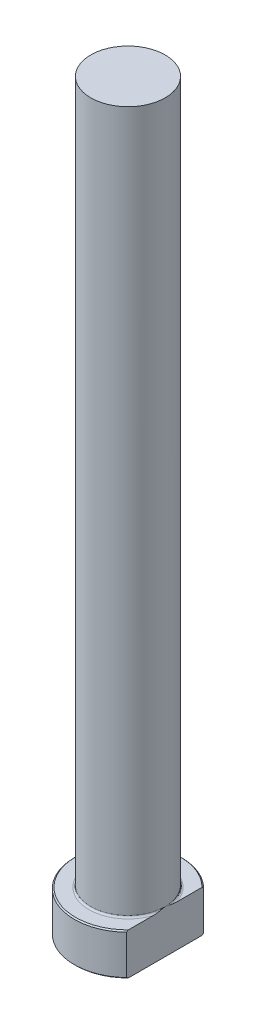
ISO-10303-21;
HEADER;
FILE_DESCRIPTION(('STEP AP214'),'2;1');
FILE_NAME('part.step','',(''),(''),'','','');
FILE_SCHEMA(('AUTOMOTIVE_DESIGN { 1 0 10303 214 1 1 1 1 }'));
ENDSEC;
DATA;
#1=APPLICATION_CONTEXT('core data for automotive mechanical design processes');
#2=APPLICATION_PROTOCOL_DEFINITION('international standard','automotive_design',2000,#1);
#3=PRODUCT_CONTEXT('',#1,'mechanical');
#4=PRODUCT('Part','Part','',(#3));
#5=PRODUCT_RELATED_PRODUCT_CATEGORY('part','',(#4));
#6=PRODUCT_DEFINITION_FORMATION('','',#4);
#7=PRODUCT_DEFINITION_CONTEXT('part definition',#1,'design');
#8=PRODUCT_DEFINITION('design','',#6,#7);
#9=PRODUCT_DEFINITION_SHAPE('','',#8);
#10=(LENGTH_UNIT() NAMED_UNIT(*) SI_UNIT(.MILLI.,.METRE.));
#11=(NAMED_UNIT(*) PLANE_ANGLE_UNIT() SI_UNIT($,.RADIAN.));
#12=(NAMED_UNIT(*) SI_UNIT($,.STERADIAN.) SOLID_ANGLE_UNIT());
#13=UNCERTAINTY_MEASURE_WITH_UNIT(LENGTH_MEASURE(1.E-05),#10,'distance_accuracy_value','');
#14=(GEOMETRIC_REPRESENTATION_CONTEXT(3) GLOBAL_UNCERTAINTY_ASSIGNED_CONTEXT((#13)) GLOBAL_UNIT_ASSIGNED_CONTEXT((#10,
#11,#12)) REPRESENTATION_CONTEXT('',''));
#15=CARTESIAN_POINT('',(0.,0.,0.));
#16=DIRECTION('',(0.,0.,1.));
#17=DIRECTION('',(1.,0.,0.));
#18=AXIS2_PLACEMENT_3D('',#15,#16,#17);
#19=CARTESIAN_POINT('',(0.,0.,0.));
#20=DIRECTION('',(0.,-1.,0.));
#21=DIRECTION('',(0.,0.,-1.));
#22=AXIS2_PLACEMENT_3D('',#19,#20,#21);
#23=PLANE('',#22);
#24=CARTESIAN_POINT('',(0.,0.,0.));
#25=DIRECTION('',(0.,-1.,0.));
#26=DIRECTION('',(0.,0.,-1.));
#27=AXIS2_PLACEMENT_3D('',#24,#25,#26);
#28=CIRCLE('',#27,8.79999999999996);
#29=CARTESIAN_POINT('',(6.24999999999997,0.,6.1949576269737));
#30=VERTEX_POINT('',#29);
#31=CARTESIAN_POINT('',(6.24999999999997,0.,-6.1949576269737));
#32=VERTEX_POINT('',#31);
#33=EDGE_CURVE('E98',#30,#32,#28,.T.);
#34=ORIENTED_EDGE('',*,*,#33,.T.);
#35=DIRECTION('',(0.,0.,1.));
#36=VECTOR('',#35,1.);
#37=CARTESIAN_POINT('',(6.24999999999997,0.,-6.47591692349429));
#38=LINE('',#37,#36);
#39=EDGE_CURVE('E83',#32,#30,#38,.T.);
#40=ORIENTED_EDGE('',*,*,#39,.T.);
#41=EDGE_LOOP('',(#34,#40));
#42=FACE_BOUND('',#41,.T.);
#43=ADVANCED_FACE('F32',(#42),#23,.T.);
#44=CARTESIAN_POINT('',(0.,259.958771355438,0.));
#45=DIRECTION('',(0.,1.,0.));
#46=DIRECTION('',(0.,0.,1.));
#47=AXIS2_PLACEMENT_3D('',#44,#45,#46);
#48=CYLINDRICAL_SURFACE('',#47,8.99999999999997);
#49=CARTESIAN_POINT('',(0.,6.79999999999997,0.));
#50=DIRECTION('',(0.,1.,0.));
#51=DIRECTION('',(0.,0.,1.));
#52=AXIS2_PLACEMENT_3D('',#49,#50,#51);
#53=CIRCLE('',#52,8.99999999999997);
#54=CARTESIAN_POINT('',(6.24999999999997,6.79999999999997,6.47591692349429));
#55=VERTEX_POINT('',#54);
#56=CARTESIAN_POINT('',(6.24999999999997,6.79999999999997,-6.47591692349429));
#57=VERTEX_POINT('',#56);
#58=EDGE_CURVE('E104',#55,#57,#53,.F.);
#59=ORIENTED_EDGE('',*,*,#58,.T.);
#60=DIRECTION('',(0.,-1.,0.));
#61=VECTOR('',#60,1.);
#62=CARTESIAN_POINT('',(6.24999999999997,125.,-6.47591692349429));
#63=LINE('',#62,#61);
#64=CARTESIAN_POINT('',(6.24999999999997,0.199999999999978,-6.47591692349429));
#65=VERTEX_POINT('',#64);
#66=EDGE_CURVE('E183',#57,#65,#63,.T.);
#67=ORIENTED_EDGE('',*,*,#66,.T.);
#68=CARTESIAN_POINT('',(0.,0.199999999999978,0.));
#69=DIRECTION('',(0.,-1.,0.));
#70=DIRECTION('',(0.,0.,-1.));
#71=AXIS2_PLACEMENT_3D('',#68,#69,#70);
#72=CIRCLE('',#71,8.99999999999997);
#73=CARTESIAN_POINT('',(6.24999999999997,0.199999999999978,6.47591692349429));
#74=VERTEX_POINT('',#73);
#75=EDGE_CURVE('E100',#65,#74,#72,.F.);
#76=ORIENTED_EDGE('',*,*,#75,.T.);
#77=DIRECTION('',(0.,-1.,0.));
#78=VECTOR('',#77,1.);
#79=CARTESIAN_POINT('',(6.24999999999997,125.,6.47591692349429));
#80=LINE('',#79,#78);
#81=EDGE_CURVE('E93',#55,#74,#80,.T.);
#82=ORIENTED_EDGE('',*,*,#81,.F.);
#83=EDGE_LOOP('',(#59,#67,#76,#82));
#84=FACE_BOUND('',#83,.T.);
#85=ADVANCED_FACE('F158',(#84),#48,.T.);
#86=CARTESIAN_POINT('',(-8.99999999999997,7.,0.));
#87=DIRECTION('',(0.,1.,0.));
#88=DIRECTION('',(0.,0.,1.));
#89=AXIS2_PLACEMENT_3D('',#86,#87,#88);
#90=PLANE('',#89);
#91=CARTESIAN_POINT('',(0.,7.,0.));
#92=DIRECTION('',(0.,1.,0.));
#93=DIRECTION('',(0.,0.,1.));
#94=AXIS2_PLACEMENT_3D('',#91,#92,#93);
#95=CIRCLE('',#94,8.79999999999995);
#96=CARTESIAN_POINT('',(6.24999999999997,7.,-6.1949576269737));
#97=VERTEX_POINT('',#96);
#98=CARTESIAN_POINT('',(6.24999999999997,7.,6.1949576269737));
#99=VERTEX_POINT('',#98);
#100=EDGE_CURVE('E178',#97,#99,#95,.T.);
#101=ORIENTED_EDGE('',*,*,#100,.T.);
#102=DIRECTION('',(0.,0.,-1.));
#103=VECTOR('',#102,1.);
#104=CARTESIAN_POINT('',(6.24999999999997,7.,0.));
#105=LINE('',#104,#103);
#106=CARTESIAN_POINT('',(6.24999999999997,6.99999999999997,1.95959179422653));
#107=VERTEX_POINT('',#106);
#108=EDGE_CURVE('E57',#99,#107,#105,.T.);
#109=ORIENTED_EDGE('',*,*,#108,.T.);
#110=CARTESIAN_POINT('',(0.,7.,0.));
#111=DIRECTION('',(0.,1.,0.));
#112=DIRECTION('',(0.,0.,1.));
#113=AXIS2_PLACEMENT_3D('',#110,#111,#112);
#114=CIRCLE('',#113,6.54999999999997);
#115=CARTESIAN_POINT('',(6.24999999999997,6.99999999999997,-1.95959179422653));
#116=VERTEX_POINT('',#115);
#117=EDGE_CURVE('E107',#107,#116,#114,.F.);
#118=ORIENTED_EDGE('',*,*,#117,.T.);
#119=EDGE_CURVE('E136',#116,#97,#105,.T.);
#120=ORIENTED_EDGE('',*,*,#119,.T.);
#121=EDGE_LOOP('',(#101,#109,#118,#120));
#122=FACE_BOUND('',#121,.T.);
#123=ADVANCED_FACE('F147',(#122),#90,.T.);
#124=CARTESIAN_POINT('',(0.,7.00000000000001,0.));
#125=DIRECTION('',(0.,-1.,0.));
#126=DIRECTION('',(0.,0.,-1.));
#127=AXIS2_PLACEMENT_3D('',#124,#125,#126);
#128=CONICAL_SURFACE('',#127,8.79999999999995,0.785398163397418);
#129=ORIENTED_EDGE('',*,*,#58,.F.);
#130=CARTESIAN_POINT('',(6.24999999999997,0.241333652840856,14.2481436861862));
#131=CARTESIAN_POINT('',(6.24999999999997,0.433510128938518,14.0382871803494));
#132=CARTESIAN_POINT('',(6.24999999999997,0.62531824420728,13.8280934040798));
#133=CARTESIAN_POINT('',(6.24999999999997,1.00808847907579,13.4069339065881));
#134=CARTESIAN_POINT('',(6.24999999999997,1.19905059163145,13.1959681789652));
#135=CARTESIAN_POINT('',(6.24999999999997,1.77058893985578,12.5616726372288));
#136=CARTESIAN_POINT('',(6.24999999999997,2.14972657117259,12.1370432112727));
#137=CARTESIAN_POINT('',(6.24999999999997,2.90544742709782,11.2804244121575));
#138=CARTESIAN_POINT('',(6.24999999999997,3.28199640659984,10.8484047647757));
#139=CARTESIAN_POINT('',(6.24999999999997,4.02800319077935,9.97835973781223));
#140=CARTESIAN_POINT('',(6.24999999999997,4.39746188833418,9.54033512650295));
#141=CARTESIAN_POINT('',(6.24999999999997,5.0661955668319,8.72902037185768));
#142=CARTESIAN_POINT('',(6.24999999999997,5.36698522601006,8.35698524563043));
#143=CARTESIAN_POINT('',(6.24999999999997,5.81091107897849,7.79312105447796));
#144=CARTESIAN_POINT('',(6.24999999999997,5.95769918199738,7.60416746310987));
#145=CARTESIAN_POINT('',(6.24999999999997,6.24834991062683,7.22402635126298));
#146=CARTESIAN_POINT('',(6.24999999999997,6.39221261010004,7.03283888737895));
#147=CARTESIAN_POINT('',(6.24999999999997,6.67624882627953,6.64809388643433));
#148=CARTESIAN_POINT('',(6.24999999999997,6.81642658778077,6.4545394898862));
#149=CARTESIAN_POINT('',(6.24999999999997,7.0925006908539,6.06440831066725));
#150=CARTESIAN_POINT('',(6.24999999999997,7.22839726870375,5.86783169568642));
#151=CARTESIAN_POINT('',(6.24999999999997,7.49487226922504,5.47121725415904));
#152=CARTESIAN_POINT('',(6.24999999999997,7.62545297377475,5.27118096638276));
#153=CARTESIAN_POINT('',(6.24999999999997,7.88005759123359,4.86699392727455));
#154=CARTESIAN_POINT('',(6.24999999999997,8.00408234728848,4.66284370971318));
#155=CARTESIAN_POINT('',(6.24999999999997,8.24192682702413,4.25315549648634));
#156=CARTESIAN_POINT('',(6.24999999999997,8.35588135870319,4.04769623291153));
#157=CARTESIAN_POINT('',(6.24999999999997,8.57376120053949,3.6314565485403));
#158=CARTESIAN_POINT('',(6.24999999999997,8.67768550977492,3.42067559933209));
#159=CARTESIAN_POINT('',(6.24999999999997,8.87268822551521,2.99352725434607));
#160=CARTESIAN_POINT('',(6.24999999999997,8.96378316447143,2.77716748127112));
#161=CARTESIAN_POINT('',(6.24999999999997,9.12997532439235,2.33835397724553));
#162=CARTESIAN_POINT('',(6.24999999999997,9.20507709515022,2.11590199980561));
#163=CARTESIAN_POINT('',(6.24999999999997,9.32245998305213,1.71047588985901));
#164=CARTESIAN_POINT('',(6.24999999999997,9.368303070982,1.5285390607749));
#165=CARTESIAN_POINT('',(6.24999999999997,9.44550018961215,1.16159607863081));
#166=CARTESIAN_POINT('',(6.24999999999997,9.47685624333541,0.976590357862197));
#167=CARTESIAN_POINT('',(6.24999999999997,9.52348341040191,0.605004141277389));
#168=CARTESIAN_POINT('',(6.24999999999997,9.53879458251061,0.418428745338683));
#169=CARTESIAN_POINT('',(6.24999999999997,9.55263073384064,0.0446485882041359));
#170=CARTESIAN_POINT('',(6.24999999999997,9.55115595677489,-0.142556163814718));
#171=CARTESIAN_POINT('',(6.24999999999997,9.53151010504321,-0.515964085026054));
#172=CARTESIAN_POINT('',(6.24999999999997,9.51334871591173,-0.702167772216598));
#173=CARTESIAN_POINT('',(6.24999999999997,9.46132296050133,-1.07235055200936));
#174=CARTESIAN_POINT('',(6.24999999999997,9.42745724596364,-1.2563294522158));
#175=CARTESIAN_POINT('',(6.24999999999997,9.34551825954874,-1.621613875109));
#176=CARTESIAN_POINT('',(6.24999999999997,9.29740414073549,-1.80291011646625));
#177=CARTESIAN_POINT('',(6.24999999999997,9.18891949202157,-2.16174722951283));
#178=CARTESIAN_POINT('',(6.24999999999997,9.12854919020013,-2.33928817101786));
#179=CARTESIAN_POINT('',(6.24999999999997,8.98038960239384,-2.73619642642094));
#180=CARTESIAN_POINT('',(6.24999999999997,8.88955370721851,-2.9544204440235));
#181=CARTESIAN_POINT('',(6.24999999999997,8.69480317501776,-3.38500003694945));
#182=CARTESIAN_POINT('',(6.24999999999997,8.59088203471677,-3.59735262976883));
#183=CARTESIAN_POINT('',(6.24999999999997,8.37253952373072,-4.01706977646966));
#184=CARTESIAN_POINT('',(6.24999999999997,8.25809823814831,-4.22442389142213));
#185=CARTESIAN_POINT('',(6.24999999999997,8.02107167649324,-4.6343477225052));
#186=CARTESIAN_POINT('',(6.24999999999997,7.89848770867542,-4.83691820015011));
#187=CARTESIAN_POINT('',(6.24999999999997,7.64548625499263,-5.24008406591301));
#188=CARTESIAN_POINT('',(6.24999999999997,7.51499955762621,-5.44063581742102));
#189=CARTESIAN_POINT('',(6.24999999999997,7.24868510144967,-5.83817237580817));
#190=CARTESIAN_POINT('',(6.24999999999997,7.11285688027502,-6.0351568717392));
#191=CARTESIAN_POINT('',(6.24999999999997,6.83683288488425,-6.42612120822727));
#192=CARTESIAN_POINT('',(6.24999999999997,6.69663581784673,-6.62010013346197));
#193=CARTESIAN_POINT('',(6.24999999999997,6.41268260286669,-7.00543858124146));
#194=CARTESIAN_POINT('',(6.24999999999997,6.26892633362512,-7.1967980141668));
#195=CARTESIAN_POINT('',(6.24999999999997,5.89056224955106,-7.69242940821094));
#196=CARTESIAN_POINT('',(6.24999999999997,5.65363599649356,-7.99493062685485));
#197=CARTESIAN_POINT('',(6.24999999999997,5.17412949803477,-8.59529922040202));
#198=CARTESIAN_POINT('',(6.24999999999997,4.93155037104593,-8.89316749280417));
#199=CARTESIAN_POINT('',(6.24999999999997,4.44181409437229,-9.4854430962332));
#200=CARTESIAN_POINT('',(6.24999999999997,4.19465400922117,-9.77984799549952));
#201=CARTESIAN_POINT('',(6.24999999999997,3.69683790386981,-10.3657062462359));
#202=CARTESIAN_POINT('',(6.24999999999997,3.44618171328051,-10.6571594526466));
#203=CARTESIAN_POINT('',(6.24999999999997,2.95199448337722,-11.2262122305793));
#204=CARTESIAN_POINT('',(6.24999999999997,2.70857128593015,-11.5039055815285));
#205=CARTESIAN_POINT('',(6.24999999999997,2.21961081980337,-12.0574158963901));
#206=CARTESIAN_POINT('',(6.24999999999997,1.97407358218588,-12.3332328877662));
#207=CARTESIAN_POINT('',(6.24999999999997,1.48150971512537,-12.882995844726));
#208=CARTESIAN_POINT('',(6.24999999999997,1.23448497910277,-13.1569435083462));
#209=CARTESIAN_POINT('',(6.24999999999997,0.738953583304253,-13.7034947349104));
#210=CARTESIAN_POINT('',(6.24999999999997,0.490446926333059,-13.9760983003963));
#211=CARTESIAN_POINT('',(6.24999999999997,0.241333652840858,-14.2481436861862));
#212=B_SPLINE_CURVE_WITH_KNOTS('',3,(#130,#131,#132,#133,#134,#135,#136,#137,#138,#139,#140,
#141,#142,#143,#144,#145,#146,#147,#148,#149,#150,#151,#152,#153,#154,#155,#156,#157,#158,#159,
#160,#161,#162,#163,#164,#165,#166,#167,#168,#169,#170,#171,#172,#173,#174,#175,#176,#177,#178,
#179,#180,#181,#182,#183,#184,#185,#186,#187,#188,#189,#190,#191,#192,#193,#194,#195,#196,#197,
#198,#199,#200,#201,#202,#203,#204,#205,#206,#207,#208,#209,#210,#211),.UNSPECIFIED.,.F.,.F.,(4,
2,2,2,2,2,2,2,2,2,2,2,2,2,2,2,2,2,2,2,2,2,2,2,2,2,2,2,2,2,2,2,2,2,2,2,2,2,2,2,4),(0.,
0.853664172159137,1.70733543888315,3.41508002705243,5.13429133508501,6.85328470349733,
8.28840776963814,9.00619588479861,9.72396585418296,10.440869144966,11.1577328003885,
11.8742854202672,12.5907456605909,13.2953619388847,14.0000484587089,14.7038184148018,
15.407387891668,15.9697505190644,16.5320345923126,17.0929114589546,17.6537801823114,
18.2143235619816,18.7749150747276,19.3371294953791,19.8993334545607,20.6078926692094,
21.3168054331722,22.027088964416,22.7372586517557,23.4549493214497,24.172702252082,
24.8906696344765,25.6086615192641,26.7612833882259,27.9136791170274,29.0668407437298,
30.2200587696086,31.3278889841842,32.4357029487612,33.5423213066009,34.6489375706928),.UNSPECIFIED.);
#213=EDGE_CURVE('E135',#55,#99,#212,.T.);
#214=ORIENTED_EDGE('',*,*,#213,.T.);
#215=ORIENTED_EDGE('',*,*,#100,.F.);
#216=EDGE_CURVE('E127',#97,#57,#212,.T.);
#217=ORIENTED_EDGE('',*,*,#216,.T.);
#218=EDGE_LOOP('',(#129,#214,#215,#217));
#219=FACE_BOUND('',#218,.T.);
#220=ADVANCED_FACE('F143',(#219),#128,.T.);
#221=CARTESIAN_POINT('',(0.,0.199999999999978,0.));
#222=DIRECTION('',(0.,1.,0.));
#223=DIRECTION('',(0.,0.,1.));
#224=AXIS2_PLACEMENT_3D('',#221,#222,#223);
#225=CONICAL_SURFACE('',#224,8.99999999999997,0.785398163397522);
#226=ORIENTED_EDGE('',*,*,#75,.F.);
#227=CARTESIAN_POINT('',(6.24999999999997,6.75866634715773,-14.2481436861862));
#228=CARTESIAN_POINT('',(6.24999999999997,6.56648987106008,-14.0382871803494));
#229=CARTESIAN_POINT('',(6.24999999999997,6.37468175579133,-13.8280934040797));
#230=CARTESIAN_POINT('',(6.24999999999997,5.99191152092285,-13.406933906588));
#231=CARTESIAN_POINT('',(6.24999999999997,5.8009494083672,-13.195968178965));
#232=CARTESIAN_POINT('',(6.24999999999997,5.22941106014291,-12.5616726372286));
#233=CARTESIAN_POINT('',(6.24999999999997,4.85027342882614,-12.1370432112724));
#234=CARTESIAN_POINT('',(6.24999999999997,4.09455257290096,-11.2804244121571));
#235=CARTESIAN_POINT('',(6.24999999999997,3.71800359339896,-10.8484047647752));
#236=CARTESIAN_POINT('',(6.24999999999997,2.97199680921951,-9.97835973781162));
#237=CARTESIAN_POINT('',(6.24999999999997,2.60253811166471,-9.54033512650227));
#238=CARTESIAN_POINT('',(6.24999999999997,1.93380443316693,-8.72902037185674));
#239=CARTESIAN_POINT('',(6.24999999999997,1.6330147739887,-8.35698524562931));
#240=CARTESIAN_POINT('',(6.24999999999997,1.18908892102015,-7.79312105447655));
#241=CARTESIAN_POINT('',(6.24999999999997,1.04230081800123,-7.60416746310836));
#242=CARTESIAN_POINT('',(6.24999999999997,0.751650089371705,-7.22402635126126));
#243=CARTESIAN_POINT('',(6.24999999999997,0.607787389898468,-7.03283888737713));
#244=CARTESIAN_POINT('',(6.24999999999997,0.323751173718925,-6.64809388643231));
#245=CARTESIAN_POINT('',(6.24999999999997,0.183573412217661,-6.45453948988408));
#246=CARTESIAN_POINT('',(6.24999999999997,-0.0925006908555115,-6.06440831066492));
#247=CARTESIAN_POINT('',(6.24999999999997,-0.228397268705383,-5.86783169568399));
#248=CARTESIAN_POINT('',(6.24999999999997,-0.494872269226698,-5.47121725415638));
#249=CARTESIAN_POINT('',(6.24999999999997,-0.625452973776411,-5.27118096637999));
#250=CARTESIAN_POINT('',(6.24999999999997,-0.880057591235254,-4.86699392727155));
#251=CARTESIAN_POINT('',(6.24999999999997,-1.00408234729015,-4.66284370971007));
#252=CARTESIAN_POINT('',(6.24999999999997,-1.24192682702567,-4.25315549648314));
#253=CARTESIAN_POINT('',(6.24999999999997,-1.35588135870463,-4.04769623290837));
#254=CARTESIAN_POINT('',(6.24999999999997,-1.57376120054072,-3.63145654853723));
#255=CARTESIAN_POINT('',(6.24999999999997,-1.67768550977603,-3.42067559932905));
#256=CARTESIAN_POINT('',(6.24999999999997,-1.8726882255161,-2.99352725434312));
#257=CARTESIAN_POINT('',(6.24999999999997,-1.96378316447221,-2.77716748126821));
#258=CARTESIAN_POINT('',(6.24999999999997,-2.1299753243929,-2.33835397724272));
#259=CARTESIAN_POINT('',(6.24999999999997,-2.20507709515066,-2.11590199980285));
#260=CARTESIAN_POINT('',(6.24999999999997,-2.32245998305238,-1.71047588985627));
#261=CARTESIAN_POINT('',(6.24999999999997,-2.36830307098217,-1.52853906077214));
#262=CARTESIAN_POINT('',(6.24999999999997,-2.44550018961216,-1.16159607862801));
#263=CARTESIAN_POINT('',(6.24999999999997,-2.47685624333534,-0.976590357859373));
#264=CARTESIAN_POINT('',(6.24999999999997,-2.52348341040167,-0.605004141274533));
#265=CARTESIAN_POINT('',(6.24999999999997,-2.53879458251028,-0.418428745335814));
#266=CARTESIAN_POINT('',(6.24999999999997,-2.55263073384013,-0.0446485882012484));
#267=CARTESIAN_POINT('',(6.24999999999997,-2.5511559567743,0.142556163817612));
#268=CARTESIAN_POINT('',(6.24999999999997,-2.53151010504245,0.515964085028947));
#269=CARTESIAN_POINT('',(6.24999999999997,-2.51334871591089,0.702167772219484));
#270=CARTESIAN_POINT('',(6.24999999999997,-2.46132296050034,1.07235055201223));
#271=CARTESIAN_POINT('',(6.24999999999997,-2.42745724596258,1.25632945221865));
#272=CARTESIAN_POINT('',(6.24999999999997,-2.34551825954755,1.62161387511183));
#273=CARTESIAN_POINT('',(6.24999999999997,-2.29740414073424,1.80291011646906));
#274=CARTESIAN_POINT('',(6.24999999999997,-2.18891949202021,2.16174722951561));
#275=CARTESIAN_POINT('',(6.24999999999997,-2.12854919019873,2.33928817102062));
#276=CARTESIAN_POINT('',(6.24999999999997,-1.98038960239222,2.736196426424));
#277=CARTESIAN_POINT('',(6.24999999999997,-1.8895537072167,2.95442044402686));
#278=CARTESIAN_POINT('',(6.24999999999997,-1.69480317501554,3.38500003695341));
#279=CARTESIAN_POINT('',(6.24999999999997,-1.59088203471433,3.59735262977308));
#280=CARTESIAN_POINT('',(6.24999999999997,-1.37253952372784,4.01706977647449));
#281=CARTESIAN_POINT('',(6.24999999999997,-1.25809823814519,4.22442389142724));
#282=CARTESIAN_POINT('',(6.24999999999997,-1.02107167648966,4.63434772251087));
#283=CARTESIAN_POINT('',(6.24999999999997,-0.898487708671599,4.83691820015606));
#284=CARTESIAN_POINT('',(6.24999999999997,-0.645486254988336,5.2400840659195));
#285=CARTESIAN_POINT('',(6.24999999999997,-0.514999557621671,5.44063581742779));
#286=CARTESIAN_POINT('',(6.24999999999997,-0.24868510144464,5.83817237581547));
#287=CARTESIAN_POINT('',(6.24999999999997,-0.112856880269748,6.03515687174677));
#288=CARTESIAN_POINT('',(6.24999999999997,0.16316711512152,6.42612120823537));
#289=CARTESIAN_POINT('',(6.24999999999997,0.303364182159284,6.62010013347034));
#290=CARTESIAN_POINT('',(6.24999999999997,0.587317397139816,7.00543858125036));
#291=CARTESIAN_POINT('',(6.24999999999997,0.73107366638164,7.19679801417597));
#292=CARTESIAN_POINT('',(6.24999999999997,1.10943775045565,7.69242940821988));
#293=CARTESIAN_POINT('',(6.24999999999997,1.34636400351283,7.99493062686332));
#294=CARTESIAN_POINT('',(6.24999999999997,1.82587050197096,8.59529922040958));
#295=CARTESIAN_POINT('',(6.24999999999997,2.06844962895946,8.89316749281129));
#296=CARTESIAN_POINT('',(6.24999999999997,2.55818590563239,9.48544309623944));
#297=CARTESIAN_POINT('',(6.24999999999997,2.80534599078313,9.77984799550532));
#298=CARTESIAN_POINT('',(6.24999999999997,3.30316209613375,10.3657062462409));
#299=CARTESIAN_POINT('',(6.24999999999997,3.55381828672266,10.6571594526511));
#300=CARTESIAN_POINT('',(6.24999999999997,4.04800551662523,11.2262122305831));
#301=CARTESIAN_POINT('',(6.24999999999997,4.29142871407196,11.5039055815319));
#302=CARTESIAN_POINT('',(6.24999999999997,4.78038918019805,12.0574158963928));
#303=CARTESIAN_POINT('',(6.24999999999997,5.02592641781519,12.3332328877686));
#304=CARTESIAN_POINT('',(6.24999999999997,5.51849028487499,12.8829958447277));
#305=CARTESIAN_POINT('',(6.24999999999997,5.76551502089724,13.1569435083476));
#306=CARTESIAN_POINT('',(6.24999999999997,6.26104641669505,13.703494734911));
#307=CARTESIAN_POINT('',(6.24999999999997,6.50955307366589,13.9760983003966));
#308=CARTESIAN_POINT('',(6.24999999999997,6.75866634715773,14.2481436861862));
#309=B_SPLINE_CURVE_WITH_KNOTS('',3,(#227,#228,#229,#230,#231,#232,#233,#234,#235,#236,#237,
#238,#239,#240,#241,#242,#243,#244,#245,#246,#247,#248,#249,#250,#251,#252,#253,#254,#255,#256,
#257,#258,#259,#260,#261,#262,#263,#264,#265,#266,#267,#268,#269,#270,#271,#272,#273,#274,#275,
#276,#277,#278,#279,#280,#281,#282,#283,#284,#285,#286,#287,#288,#289,#290,#291,#292,#293,#294,
#295,#296,#297,#298,#299,#300,#301,#302,#303,#304,#305,#306,#307,#308),.UNSPECIFIED.,.F.,.F.,(4,
2,2,2,2,2,2,2,2,2,2,2,2,2,2,2,2,2,2,2,2,2,2,2,2,2,2,2,2,2,2,2,2,2,2,2,2,2,2,2,4),(0.,
0.853664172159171,1.70733543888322,3.41508002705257,5.13429133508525,6.85328470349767,
8.28840776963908,9.00619588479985,9.72396585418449,10.4408691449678,11.1577328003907,
11.8742854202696,12.5907456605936,13.2953619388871,14.0000484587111,14.7038184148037,
15.4073878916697,15.9697505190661,16.5320345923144,17.0929114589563,17.6537801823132,
18.2143235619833,18.7749150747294,19.3371294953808,19.8993334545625,20.6078926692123,
21.3168054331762,22.027088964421,22.7372586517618,23.4549493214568,24.1727022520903,
24.8906696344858,25.6086615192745,26.7612833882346,27.9136791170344,29.0668407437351,
30.2200587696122,31.3278889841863,32.4357029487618,33.5423213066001,34.6489375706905),.UNSPECIFIED.);
#310=EDGE_CURVE('E86',#65,#32,#309,.T.);
#311=ORIENTED_EDGE('',*,*,#310,.T.);
#312=ORIENTED_EDGE('',*,*,#33,.F.);
#313=EDGE_CURVE('E89',#30,#74,#309,.T.);
#314=ORIENTED_EDGE('',*,*,#313,.T.);
#315=EDGE_LOOP('',(#226,#311,#312,#314));
#316=FACE_BOUND('',#315,.T.);
#317=ADVANCED_FACE('F97',(#316),#225,.T.);
#318=CARTESIAN_POINT('',(0.,7.29999999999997,0.));
#319=DIRECTION('',(0.,1.,0.));
#320=DIRECTION('',(0.,0.,1.));
#321=AXIS2_PLACEMENT_3D('',#318,#319,#320);
#322=TOROIDAL_SURFACE('',#321,6.54999999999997,0.3);
#323=CARTESIAN_POINT('',(6.24999999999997,7.29999999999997,0.));
#324=CARTESIAN_POINT('',(6.24999999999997,7.30000062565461,1.07935811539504E-10));
#325=CARTESIAN_POINT('',(6.24999999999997,7.30000125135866,-2.93503388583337E-07));
#326=CARTESIAN_POINT('',(6.24999999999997,7.300002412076,-1.07409020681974E-06));
#327=CARTESIAN_POINT('',(6.24999999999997,7.30000292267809,-1.58214987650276E-06));
#328=CARTESIAN_POINT('',(6.24999999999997,7.30000400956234,-2.8081901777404E-06));
#329=CARTESIAN_POINT('',(6.24999999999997,7.30000456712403,-3.54604295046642E-06));
#330=CARTESIAN_POINT('',(6.24999999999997,7.30000554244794,-5.05412397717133E-06));
#331=CARTESIAN_POINT('',(6.24999999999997,7.30000596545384,-5.82130991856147E-06));
#332=CARTESIAN_POINT('',(6.24999999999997,7.30000759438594,-8.87270548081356E-06));
#333=CARTESIAN_POINT('',(6.24999999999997,7.30000872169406,-1.1203275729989E-05));
#334=CARTESIAN_POINT('',(6.24999999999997,7.30001051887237,-1.57552363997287E-05));
#335=CARTESIAN_POINT('',(6.24999999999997,7.30001122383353,-1.79632548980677E-05));
#336=CARTESIAN_POINT('',(6.24999999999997,7.30001427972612,-2.752581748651E-05));
#337=CARTESIAN_POINT('',(6.24999999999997,7.30001663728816,-3.48805238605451E-05));
#338=CARTESIAN_POINT('',(6.24999999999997,7.30002001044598,-4.8619148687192E-05));
#339=CARTESIAN_POINT('',(6.24999999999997,7.30002118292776,-5.49639235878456E-05));
#340=CARTESIAN_POINT('',(6.24999999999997,7.30002986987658,-0.000102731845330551));
#341=CARTESIAN_POINT('',(6.24999999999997,7.30003662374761,-0.000144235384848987));
#342=CARTESIAN_POINT('',(6.24999999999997,7.30006617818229,-0.000309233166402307));
#343=CARTESIAN_POINT('',(6.24999999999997,7.3000942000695,-0.000431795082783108));
#344=CARTESIAN_POINT('',(6.24999999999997,7.30020410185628,-0.000919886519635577));
#345=CARTESIAN_POINT('',(6.24999999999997,7.3002827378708,-0.00128589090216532));
#346=CARTESIAN_POINT('',(6.24999999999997,7.30059929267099,-0.00274922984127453));
#347=CARTESIAN_POINT('',(6.24999999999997,7.30084138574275,-0.00384592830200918));
#348=CARTESIAN_POINT('',(6.24999999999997,7.30185366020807,-0.00844291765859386));
#349=CARTESIAN_POINT('',(6.24999999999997,7.30261854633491,-0.0119440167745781));
#350=CARTESIAN_POINT('',(6.24999999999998,7.30934535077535,-0.0427197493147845));
#351=CARTESIAN_POINT('',(6.24999999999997,7.31532845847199,-0.0699912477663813));
#352=CARTESIAN_POINT('',(6.24999999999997,7.32701994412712,-0.1234289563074));
#353=CARTESIAN_POINT('',(6.24999999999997,7.33272958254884,-0.14959492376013));
#354=CARTESIAN_POINT('',(6.24999999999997,7.34485779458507,-0.205323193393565));
#355=CARTESIAN_POINT('',(6.24999999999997,7.35127239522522,-0.23488638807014));
#356=CARTESIAN_POINT('',(6.24999999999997,7.36411066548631,-0.294356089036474));
#357=CARTESIAN_POINT('',(6.24999999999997,7.37053363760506,-0.324262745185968));
#358=CARTESIAN_POINT('',(6.24999999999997,7.38584616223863,-0.396051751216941));
#359=CARTESIAN_POINT('',(6.24999999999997,7.39469543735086,-0.437942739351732));
#360=CARTESIAN_POINT('',(6.24999999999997,7.41192932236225,-0.520630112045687));
#361=CARTESIAN_POINT('',(6.24999999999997,7.42032002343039,-0.561425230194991));
#362=CARTESIAN_POINT('',(6.24999999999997,7.44742205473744,-0.69545636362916));
#363=CARTESIAN_POINT('',(6.24999999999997,7.4655604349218,-0.788810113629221));
#364=CARTESIAN_POINT('',(6.24999999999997,7.49982037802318,-0.976827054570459));
#365=CARTESIAN_POINT('',(6.24999999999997,7.51592073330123,-1.07149417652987));
#366=CARTESIAN_POINT('',(6.24999999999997,7.54633300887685,-1.27034734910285));
#367=CARTESIAN_POINT('',(6.24999999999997,7.56032934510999,-1.37458266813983));
#368=CARTESIAN_POINT('',(6.24999999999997,7.58288660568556,-1.58337219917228));
#369=CARTESIAN_POINT('',(6.24999999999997,7.59146383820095,-1.68792449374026));
#370=CARTESIAN_POINT('',(6.24999999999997,7.59839530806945,-1.84328437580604));
#371=CARTESIAN_POINT('',(6.24999999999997,7.59974160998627,-1.89395725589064));
#372=CARTESIAN_POINT('',(6.24999999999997,7.60019235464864,-1.99536854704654));
#373=CARTESIAN_POINT('',(6.24999999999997,7.59929473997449,-2.04610697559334));
#374=CARTESIAN_POINT('',(6.24999999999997,7.59472992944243,-2.14676570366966));
#375=CARTESIAN_POINT('',(6.24999999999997,7.5911010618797,-2.19668764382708));
#376=CARTESIAN_POINT('',(6.24999999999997,7.58034281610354,-2.29612823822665));
#377=CARTESIAN_POINT('',(6.24999999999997,7.57321785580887,-2.3456473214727));
#378=CARTESIAN_POINT('',(6.24999999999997,7.55883861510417,-2.41968621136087));
#379=CARTESIAN_POINT('',(6.24999999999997,7.55336305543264,-2.44455073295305));
#380=CARTESIAN_POINT('',(6.24999999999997,7.54088765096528,-2.49388968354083));
#381=CARTESIAN_POINT('',(6.24999999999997,7.53388865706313,-2.51836432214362));
#382=CARTESIAN_POINT('',(6.24999999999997,7.5180160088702,-2.56658659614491));
#383=CARTESIAN_POINT('',(6.24999999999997,7.50915079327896,-2.59033697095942));
#384=CARTESIAN_POINT('',(6.24999999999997,7.48896575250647,-2.63675110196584));
#385=CARTESIAN_POINT('',(6.24999999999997,7.47765263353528,-2.65941762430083));
#386=CARTESIAN_POINT('',(6.24999999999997,7.45696632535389,-2.69385500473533));
#387=CARTESIAN_POINT('',(6.24999999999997,7.4486983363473,-2.70628406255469));
#388=CARTESIAN_POINT('',(6.24999999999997,7.43069170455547,-2.73004308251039));
#389=CARTESIAN_POINT('',(6.24999999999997,7.42095514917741,-2.74137456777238));
#390=CARTESIAN_POINT('',(6.24999999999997,7.40313125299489,-2.75886410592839));
#391=CARTESIAN_POINT('',(6.24999999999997,7.39552792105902,-2.76551055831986));
#392=CARTESIAN_POINT('',(6.24999999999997,7.37942171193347,-2.77761940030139));
#393=CARTESIAN_POINT('',(6.24999999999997,7.37092027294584,-2.78308364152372));
#394=CARTESIAN_POINT('',(6.24999999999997,7.3552039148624,-2.79123019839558));
#395=CARTESIAN_POINT('',(6.24999999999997,7.34817405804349,-2.79426565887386));
#396=CARTESIAN_POINT('',(6.24999999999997,7.33371058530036,-2.79914227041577));
#397=CARTESIAN_POINT('',(6.24999999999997,7.32627746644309,-2.80098485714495));
#398=CARTESIAN_POINT('',(6.24999999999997,7.31114486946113,-2.80329865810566));
#399=CARTESIAN_POINT('',(6.24999999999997,7.30344395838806,-2.8037607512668));
#400=CARTESIAN_POINT('',(6.24999999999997,7.28809169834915,-2.80323167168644));
#401=CARTESIAN_POINT('',(6.24999999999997,7.28044035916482,-2.8022402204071));
#402=CARTESIAN_POINT('',(6.24999999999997,7.26612892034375,-2.79907216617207));
#403=CARTESIAN_POINT('',(6.24999999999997,7.25944213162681,-2.79701213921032));
#404=CARTESIAN_POINT('',(6.24999999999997,7.24643877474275,-2.79195274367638));
#405=CARTESIAN_POINT('',(6.24999999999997,7.24012234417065,-2.78895302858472));
#406=CARTESIAN_POINT('',(6.24999999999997,7.2241404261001,-2.78010234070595));
#407=CARTESIAN_POINT('',(6.24999999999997,7.21481747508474,-2.77363492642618));
#408=CARTESIAN_POINT('',(6.24999999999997,7.19727307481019,-2.75934472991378));
#409=CARTESIAN_POINT('',(6.24999999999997,7.18905534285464,-2.75151756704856));
#410=CARTESIAN_POINT('',(6.24999999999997,7.16746274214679,-2.72838666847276));
#411=CARTESIAN_POINT('',(6.24999999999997,7.15517318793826,-2.71208063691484));
#412=CARTESIAN_POINT('',(6.24999999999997,7.13297830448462,-2.67797126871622));
#413=CARTESIAN_POINT('',(6.24999999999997,7.12307686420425,-2.66016555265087));
#414=CARTESIAN_POINT('',(6.24999999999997,7.10185271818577,-2.61712561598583));
#415=CARTESIAN_POINT('',(6.24999999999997,7.09129494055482,-2.59151849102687));
#416=CARTESIAN_POINT('',(6.24999999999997,7.07260379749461,-2.53941658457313));
#417=CARTESIAN_POINT('',(6.24999999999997,7.06447530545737,-2.51292013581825));
#418=CARTESIAN_POINT('',(6.24999999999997,7.05002040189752,-2.45908915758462));
#419=CARTESIAN_POINT('',(6.24999999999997,7.04371803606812,-2.43174827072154));
#420=CARTESIAN_POINT('',(6.24999999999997,7.03267951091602,-2.37679196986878));
#421=CARTESIAN_POINT('',(6.24999999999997,7.0279416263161,-2.34917689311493));
#422=CARTESIAN_POINT('',(6.24999999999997,7.01732549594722,-2.27736486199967));
#423=CARTESIAN_POINT('',(6.24999999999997,7.01243082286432,-2.23302306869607));
#424=CARTESIAN_POINT('',(6.24999999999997,7.00516057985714,-2.1441265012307));
#425=CARTESIAN_POINT('',(6.24999999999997,7.00278642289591,-2.099571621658));
#426=CARTESIAN_POINT('',(6.24999999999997,6.99868217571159,-1.96551117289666));
#427=CARTESIAN_POINT('',(6.24999999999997,7.0000072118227,-1.87591316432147));
#428=CARTESIAN_POINT('',(6.24999999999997,7.0080292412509,-1.70248618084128));
#429=CARTESIAN_POINT('',(6.24999999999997,7.01439439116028,-1.61863796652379));
#430=CARTESIAN_POINT('',(6.24999999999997,7.03083822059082,-1.45127006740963));
#431=CARTESIAN_POINT('',(6.24999999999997,7.04091883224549,-1.3677505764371));
#432=CARTESIAN_POINT('',(6.24999999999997,7.06480380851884,-1.19431308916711));
#433=CARTESIAN_POINT('',(6.24999999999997,7.07884475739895,-1.10442856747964));
#434=CARTESIAN_POINT('',(6.24999999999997,7.10969415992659,-0.922729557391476));
#435=CARTESIAN_POINT('',(6.24999999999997,7.12656524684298,-0.830925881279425));
#436=CARTESIAN_POINT('',(6.24999999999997,7.15670076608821,-0.67515179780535));
#437=CARTESIAN_POINT('',(6.24999999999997,7.16952837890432,-0.611095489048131));
#438=CARTESIAN_POINT('',(6.24999999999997,7.19564112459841,-0.483838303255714));
#439=CARTESIAN_POINT('',(6.24999999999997,7.2089193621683,-0.420636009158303));
#440=CARTESIAN_POINT('',(6.24999999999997,7.23428285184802,-0.301644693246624));
#441=CARTESIAN_POINT('',(6.24999999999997,7.24632762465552,-0.245846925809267));
#442=CARTESIAN_POINT('',(6.24999999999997,7.27113004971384,-0.131848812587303));
#443=CARTESIAN_POINT('',(6.24999999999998,7.28389583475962,-0.0736501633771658));
#444=CARTESIAN_POINT('',(6.24999999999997,7.29738281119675,-0.0119373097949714));
#445=CARTESIAN_POINT('',(6.24999999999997,7.29814924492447,-0.00842953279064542));
#446=CARTESIAN_POINT('',(6.24999999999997,7.2991618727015,-0.00383105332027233));
#447=CARTESIAN_POINT('',(6.24999999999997,7.29940281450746,-0.00273954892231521));
#448=CARTESIAN_POINT('',(6.24999999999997,7.29971797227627,-0.00128266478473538));
#449=CARTESIAN_POINT('',(6.24999999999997,7.29979633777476,-0.000917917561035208));
#450=CARTESIAN_POINT('',(6.24999999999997,7.29990591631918,-0.000431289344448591));
#451=CARTESIAN_POINT('',(6.24999999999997,7.29993389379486,-0.000308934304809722));
#452=CARTESIAN_POINT('',(6.24999999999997,7.29996340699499,-0.00014417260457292));
#453=CARTESIAN_POINT('',(6.24999999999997,7.29997015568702,-0.000102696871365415));
#454=CARTESIAN_POINT('',(6.24999999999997,7.29997883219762,-5.49575231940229E-05));
#455=CARTESIAN_POINT('',(6.24999999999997,7.29998000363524,-4.86141750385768E-05));
#456=CARTESIAN_POINT('',(6.24999999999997,7.29998337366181,-3.48785875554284E-05));
#457=CARTESIAN_POINT('',(6.24999999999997,7.29998572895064,-2.75254181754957E-05));
#458=CARTESIAN_POINT('',(6.24999999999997,7.29998878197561,-1.79644811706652E-05));
#459=CARTESIAN_POINT('',(6.24999999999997,7.29998948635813,-1.57565691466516E-05));
#460=CARTESIAN_POINT('',(6.24999999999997,7.29999128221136,-1.12047374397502E-05));
#461=CARTESIAN_POINT('',(6.24999999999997,7.29999240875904,-8.87417477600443E-06));
#462=CARTESIAN_POINT('',(6.24999999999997,7.29999403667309,-5.82269238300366E-06));
#463=CARTESIAN_POINT('',(6.24999999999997,7.29999445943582,-5.05545097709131E-06));
#464=CARTESIAN_POINT('',(6.24999999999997,7.29999543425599,-3.54721514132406E-06));
#465=CARTESIAN_POINT('',(6.24999999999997,7.29999599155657,-2.80926073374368E-06));
#466=CARTESIAN_POINT('',(6.24999999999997,7.29999707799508,-1.58298694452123E-06));
#467=CARTESIAN_POINT('',(6.24999999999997,7.29999758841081,-1.07480544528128E-06));
#468=CARTESIAN_POINT('',(6.24999999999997,7.29999874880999,-2.93902319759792E-07));
#469=CARTESIAN_POINT('',(6.24999999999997,7.29999937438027,-1.07929784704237E-10));
#470=CARTESIAN_POINT('',(6.24999999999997,7.29999999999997,0.));
#471=B_SPLINE_CURVE_WITH_KNOTS('',3,(#323,#324,#325,#326,#327,#328,#329,#330,#331,#332,#333,
#334,#335,#336,#337,#338,#339,#340,#341,#342,#343,#344,#345,#346,#347,#348,#349,#350,#351,#352,
#353,#354,#355,#356,#357,#358,#359,#360,#361,#362,#363,#364,#365,#366,#367,#368,#369,#370,#371,
#372,#373,#374,#375,#376,#377,#378,#379,#380,#381,#382,#383,#384,#385,#386,#387,#388,#389,#390,
#391,#392,#393,#394,#395,#396,#397,#398,#399,#400,#401,#402,#403,#404,#405,#406,#407,#408,#409,
#410,#411,#412,#413,#414,#415,#416,#417,#418,#419,#420,#421,#422,#423,#424,#425,#426,#427,#428,
#429,#430,#431,#432,#433,#434,#435,#436,#437,#438,#439,#440,#441,#442,#443,#444,#445,#446,#447,
#448,#449,#450,#451,#452,#453,#454,#455,#456,#457,#458,#459,#460,#461,#462,#463,#464,#465,#466,
#467,#468,#469,#470),.UNSPECIFIED.,.T.,.F.,(4,2,2,2,2,2,2,2,2,2,2,2,2,2,2,2,2,2,2,2,2,2,2,2,2,2,
2,2,2,2,2,2,2,2,2,2,2,2,2,2,2,2,2,2,2,2,2,2,2,2,2,2,2,2,2,2,2,2,2,2,2,2,2,2,2,2,2,2,2,2,2,2,2,
4),(0.,1.91133621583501E-06,4.08629145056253E-06,6.84045192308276E-06,9.46814795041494E-06,
1.72102324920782E-05,2.41571318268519E-05,4.72958844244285E-05,6.66312210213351E-05,
0.000192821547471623,0.000569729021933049,0.0016930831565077,0.00506203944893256,
0.0158134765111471,0.0995718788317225,0.17991734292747,0.270670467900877,0.362436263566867,
0.49088205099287,0.615829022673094,0.901110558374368,1.18915184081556,1.50457944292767,
1.81905322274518,1.97108855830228,2.1232633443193,2.27334154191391,2.42323057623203,
2.49957602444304,2.5758789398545,2.65184396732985,2.72760346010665,2.77231358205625,
2.81696074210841,2.84717821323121,2.87734800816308,2.90023250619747,2.92308941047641,
2.94609700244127,2.96910900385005,2.99001820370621,3.01093512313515,3.04477802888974,
3.07873205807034,3.13964269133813,3.20065185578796,3.28355317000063,3.36661969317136,
3.45073488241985,3.53475699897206,3.66848651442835,3.80229095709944,4.07081278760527,
4.32299246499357,4.57530346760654,4.8481846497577,5.12818350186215,5.32416473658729,
5.51790851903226,5.68915816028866,5.86790059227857,5.87867257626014,5.88202557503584,
5.88314507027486,5.88352134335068,5.88364744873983,5.88366677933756,5.88368991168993,
5.88369685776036,5.88370459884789,5.88370722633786,5.8837099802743,5.88371215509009,
5.88371406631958),.UNSPECIFIED.);
#472=CARTESIAN_POINT('',(6.24999999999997,7.29999999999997,0.));
#473=VERTEX_POINT('',#472);
#474=EDGE_CURVE('E11',#116,#473,#471,.T.);
#475=ORIENTED_EDGE('',*,*,#474,.F.);
#476=ORIENTED_EDGE('',*,*,#117,.F.);
#477=CARTESIAN_POINT('',(6.24999999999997,7.29999999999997,0.));
#478=CARTESIAN_POINT('',(6.24999999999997,7.29999937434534,-1.07935744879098E-10));
#479=CARTESIAN_POINT('',(6.24999999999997,7.29999874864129,2.93503388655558E-07));
#480=CARTESIAN_POINT('',(6.24999999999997,7.29999758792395,1.07409020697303E-06));
#481=CARTESIAN_POINT('',(6.24999999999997,7.29999707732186,1.58214987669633E-06));
#482=CARTESIAN_POINT('',(6.24999999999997,7.2999959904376,2.80819017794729E-06));
#483=CARTESIAN_POINT('',(6.24999999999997,7.29999543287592,3.54604295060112E-06));
#484=CARTESIAN_POINT('',(6.24999999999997,7.29999445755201,5.05412397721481E-06));
#485=CARTESIAN_POINT('',(6.24999999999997,7.29999403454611,5.82130991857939E-06));
#486=CARTESIAN_POINT('',(6.24999999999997,7.29999240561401,8.87270548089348E-06));
#487=CARTESIAN_POINT('',(6.24999999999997,7.29999127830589,1.12032757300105E-05));
#488=CARTESIAN_POINT('',(6.24999999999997,7.29998948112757,1.57552363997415E-05));
#489=CARTESIAN_POINT('',(6.24999999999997,7.29998877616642,1.79632548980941E-05));
#490=CARTESIAN_POINT('',(6.24999999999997,7.29998572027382,2.75258174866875E-05));
#491=CARTESIAN_POINT('',(6.24999999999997,7.29998336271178,3.48805238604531E-05));
#492=CARTESIAN_POINT('',(6.24999999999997,7.29997998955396,4.86191486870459E-05));
#493=CARTESIAN_POINT('',(6.24999999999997,7.29997881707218,5.49639235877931E-05));
#494=CARTESIAN_POINT('',(6.24999999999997,7.29997013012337,0.000102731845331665));
#495=CARTESIAN_POINT('',(6.24999999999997,7.29996337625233,0.000144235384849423));
#496=CARTESIAN_POINT('',(6.24999999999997,7.29993382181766,0.000309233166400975));
#497=CARTESIAN_POINT('',(6.24999999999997,7.29990579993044,0.000431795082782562));
#498=CARTESIAN_POINT('',(6.24999999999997,7.29979589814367,0.000919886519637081));
#499=CARTESIAN_POINT('',(6.24999999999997,7.29971726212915,0.0012858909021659));
#500=CARTESIAN_POINT('',(6.24999999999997,7.29940070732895,0.00274922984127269));
#501=CARTESIAN_POINT('',(6.24999999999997,7.29915861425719,0.00384592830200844));
#502=CARTESIAN_POINT('',(6.24999999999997,7.29814633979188,0.0084429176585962));
#503=CARTESIAN_POINT('',(6.24999999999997,7.29738145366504,0.0119440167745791));
#504=CARTESIAN_POINT('',(6.24999999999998,7.29065464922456,0.0427197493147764));
#505=CARTESIAN_POINT('',(6.24999999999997,7.28467154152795,0.0699912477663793));
#506=CARTESIAN_POINT('',(6.24999999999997,7.27298005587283,0.123428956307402));
#507=CARTESIAN_POINT('',(6.24999999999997,7.2672704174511,0.14959492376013));
#508=CARTESIAN_POINT('',(6.24999999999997,7.25514220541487,0.205323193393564));
#509=CARTESIAN_POINT('',(6.24999999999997,7.24872760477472,0.23488638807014));
#510=CARTESIAN_POINT('',(6.24999999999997,7.23588933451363,0.294356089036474));
#511=CARTESIAN_POINT('',(6.24999999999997,7.22946636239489,0.324262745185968));
#512=CARTESIAN_POINT('',(6.24999999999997,7.21415383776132,0.396051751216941));
#513=CARTESIAN_POINT('',(6.24999999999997,7.20530456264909,0.437942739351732));
#514=CARTESIAN_POINT('',(6.24999999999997,7.1880706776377,0.520630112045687));
#515=CARTESIAN_POINT('',(6.24999999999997,7.17967997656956,0.561425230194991));
#516=CARTESIAN_POINT('',(6.24999999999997,7.15257794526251,0.69545636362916));
#517=CARTESIAN_POINT('',(6.24999999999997,7.13443956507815,0.788810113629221));
#518=CARTESIAN_POINT('',(6.24999999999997,7.10017962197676,0.976827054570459));
#519=CARTESIAN_POINT('',(6.24999999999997,7.08407926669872,1.07149417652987));
#520=CARTESIAN_POINT('',(6.24999999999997,7.05366699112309,1.27034734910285));
#521=CARTESIAN_POINT('',(6.24999999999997,7.03967065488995,1.37458266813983));
#522=CARTESIAN_POINT('',(6.24999999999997,7.01711339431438,1.58337219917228));
#523=CARTESIAN_POINT('',(6.24999999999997,7.00853616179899,1.68792449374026));
#524=CARTESIAN_POINT('',(6.24999999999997,7.00160469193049,1.84328437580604));
#525=CARTESIAN_POINT('',(6.24999999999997,7.00025839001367,1.89395725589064));
#526=CARTESIAN_POINT('',(6.24999999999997,6.9998076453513,1.99536854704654));
#527=CARTESIAN_POINT('',(6.24999999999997,7.00070526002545,2.04610697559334));
#528=CARTESIAN_POINT('',(6.24999999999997,7.00527007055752,2.14676570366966));
#529=CARTESIAN_POINT('',(6.24999999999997,7.00889893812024,2.19668764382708));
#530=CARTESIAN_POINT('',(6.24999999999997,7.0196571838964,2.29612823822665));
#531=CARTESIAN_POINT('',(6.24999999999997,7.02678214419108,2.3456473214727));
#532=CARTESIAN_POINT('',(6.24999999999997,7.04116138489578,2.41968621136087));
#533=CARTESIAN_POINT('',(6.24999999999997,7.04663694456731,2.44455073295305));
#534=CARTESIAN_POINT('',(6.24999999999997,7.05911234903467,2.49388968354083));
#535=CARTESIAN_POINT('',(6.24999999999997,7.06611134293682,2.51836432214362));
#536=CARTESIAN_POINT('',(6.24999999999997,7.08198399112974,2.56658659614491));
#537=CARTESIAN_POINT('',(6.24999999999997,7.09084920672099,2.59033697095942));
#538=CARTESIAN_POINT('',(6.24999999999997,7.11103424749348,2.63675110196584));
#539=CARTESIAN_POINT('',(6.24999999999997,7.12234736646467,2.65941762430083));
#540=CARTESIAN_POINT('',(6.24999999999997,7.14303367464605,2.69385500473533));
#541=CARTESIAN_POINT('',(6.24999999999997,7.15130166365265,2.70628406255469));
#542=CARTESIAN_POINT('',(6.24999999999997,7.16930829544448,2.73004308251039));
#543=CARTESIAN_POINT('',(6.24999999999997,7.17904485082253,2.74137456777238));
#544=CARTESIAN_POINT('',(6.24999999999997,7.19686874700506,2.75886410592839));
#545=CARTESIAN_POINT('',(6.24999999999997,7.20447207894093,2.76551055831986));
#546=CARTESIAN_POINT('',(6.24999999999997,7.22057828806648,2.77761940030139));
#547=CARTESIAN_POINT('',(6.24999999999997,7.2290797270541,2.78308364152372));
#548=CARTESIAN_POINT('',(6.24999999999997,7.24479608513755,2.79123019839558));
#549=CARTESIAN_POINT('',(6.24999999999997,7.25182594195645,2.79426565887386));
#550=CARTESIAN_POINT('',(6.24999999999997,7.26628941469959,2.79914227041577));
#551=CARTESIAN_POINT('',(6.24999999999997,7.27372253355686,2.80098485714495));
#552=CARTESIAN_POINT('',(6.24999999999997,7.28885513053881,2.80329865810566));
#553=CARTESIAN_POINT('',(6.24999999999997,7.29655604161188,2.8037607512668));
#554=CARTESIAN_POINT('',(6.24999999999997,7.3119083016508,2.80323167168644));
#555=CARTESIAN_POINT('',(6.24999999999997,7.31955964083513,2.8022402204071));
#556=CARTESIAN_POINT('',(6.24999999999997,7.3338710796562,2.79907216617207));
#557=CARTESIAN_POINT('',(6.24999999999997,7.34055786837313,2.79701213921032));
#558=CARTESIAN_POINT('',(6.24999999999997,7.3535612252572,2.79195274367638));
#559=CARTESIAN_POINT('',(6.24999999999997,7.3598776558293,2.78895302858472));
#560=CARTESIAN_POINT('',(6.24999999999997,7.37585957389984,2.78010234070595));
#561=CARTESIAN_POINT('',(6.24999999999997,7.38518252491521,2.77363492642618));
#562=CARTESIAN_POINT('',(6.24999999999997,7.40272692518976,2.75934472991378));
#563=CARTESIAN_POINT('',(6.24999999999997,7.41094465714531,2.75151756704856));
#564=CARTESIAN_POINT('',(6.24999999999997,7.43253725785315,2.72838666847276));
#565=CARTESIAN_POINT('',(6.24999999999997,7.44482681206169,2.71208063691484));
#566=CARTESIAN_POINT('',(6.24999999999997,7.46702169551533,2.67797126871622));
#567=CARTESIAN_POINT('',(6.24999999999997,7.47692313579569,2.66016555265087));
#568=CARTESIAN_POINT('',(6.24999999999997,7.49814728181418,2.61712561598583));
#569=CARTESIAN_POINT('',(6.24999999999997,7.50870505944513,2.59151849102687));
#570=CARTESIAN_POINT('',(6.24999999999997,7.52739620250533,2.53941658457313));
#571=CARTESIAN_POINT('',(6.24999999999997,7.53552469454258,2.51292013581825));
#572=CARTESIAN_POINT('',(6.24999999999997,7.54997959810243,2.45908915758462));
#573=CARTESIAN_POINT('',(6.24999999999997,7.55628196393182,2.43174827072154));
#574=CARTESIAN_POINT('',(6.24999999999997,7.56732048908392,2.37679196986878));
#575=CARTESIAN_POINT('',(6.24999999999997,7.57205837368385,2.34917689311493));
#576=CARTESIAN_POINT('',(6.24999999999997,7.58267450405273,2.27736486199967));
#577=CARTESIAN_POINT('',(6.24999999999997,7.58756917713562,2.23302306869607));
#578=CARTESIAN_POINT('',(6.24999999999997,7.59483942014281,2.1441265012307));
#579=CARTESIAN_POINT('',(6.24999999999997,7.59721357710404,2.099571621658));
#580=CARTESIAN_POINT('',(6.24999999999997,7.60131782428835,1.96551117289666));
#581=CARTESIAN_POINT('',(6.24999999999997,7.59999278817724,1.87591316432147));
#582=CARTESIAN_POINT('',(6.24999999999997,7.59197075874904,1.70248618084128));
#583=CARTESIAN_POINT('',(6.24999999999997,7.58560560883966,1.61863796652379));
#584=CARTESIAN_POINT('',(6.24999999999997,7.56916177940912,1.45127006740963));
#585=CARTESIAN_POINT('',(6.24999999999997,7.55908116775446,1.3677505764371));
#586=CARTESIAN_POINT('',(6.24999999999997,7.53519619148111,1.19431308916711));
#587=CARTESIAN_POINT('',(6.24999999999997,7.52115524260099,1.10442856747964));
#588=CARTESIAN_POINT('',(6.24999999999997,7.49030584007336,0.922729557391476));
#589=CARTESIAN_POINT('',(6.24999999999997,7.47343475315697,0.830925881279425));
#590=CARTESIAN_POINT('',(6.24999999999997,7.44329923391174,0.67515179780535));
#591=CARTESIAN_POINT('',(6.24999999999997,7.43047162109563,0.611095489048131));
#592=CARTESIAN_POINT('',(6.24999999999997,7.40435887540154,0.483838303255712));
#593=CARTESIAN_POINT('',(6.24999999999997,7.39108063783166,0.4206360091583));
#594=CARTESIAN_POINT('',(6.24999999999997,7.36571714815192,0.301644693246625));
#595=CARTESIAN_POINT('',(6.24999999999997,7.3536723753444,0.245846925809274));
#596=CARTESIAN_POINT('',(6.24999999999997,7.32886995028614,0.131848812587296));
#597=CARTESIAN_POINT('',(6.24999999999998,7.31610416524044,0.0736501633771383));
#598=CARTESIAN_POINT('',(6.24999999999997,7.30261718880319,0.011937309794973));
#599=CARTESIAN_POINT('',(6.24999999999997,7.30185075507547,0.00842953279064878));
#600=CARTESIAN_POINT('',(6.24999999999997,7.30083812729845,0.00383105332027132));
#601=CARTESIAN_POINT('',(6.24999999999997,7.3005971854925,0.0027395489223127));
#602=CARTESIAN_POINT('',(6.24999999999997,7.30028202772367,0.00128266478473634));
#603=CARTESIAN_POINT('',(6.24999999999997,7.30020366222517,0.000917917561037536));
#604=CARTESIAN_POINT('',(6.24999999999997,7.30009408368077,0.000431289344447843));
#605=CARTESIAN_POINT('',(6.24999999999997,7.30006610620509,0.000308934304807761));
#606=CARTESIAN_POINT('',(6.24999999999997,7.30003659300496,0.000144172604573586));
#607=CARTESIAN_POINT('',(6.24999999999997,7.30002984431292,0.0001026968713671));
#608=CARTESIAN_POINT('',(6.24999999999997,7.30002116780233,5.49575231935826E-05));
#609=CARTESIAN_POINT('',(6.24999999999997,7.3000199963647,4.86141750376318E-05));
#610=CARTESIAN_POINT('',(6.24999999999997,7.30001662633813,3.48785875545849E-05));
#611=CARTESIAN_POINT('',(6.24999999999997,7.30001427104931,2.75254181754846E-05));
#612=CARTESIAN_POINT('',(6.24999999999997,7.30001121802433,1.79644811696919E-05));
#613=CARTESIAN_POINT('',(6.24999999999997,7.30001051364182,1.57565691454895E-05));
#614=CARTESIAN_POINT('',(6.24999999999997,7.30000871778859,1.12047374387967E-05));
#615=CARTESIAN_POINT('',(6.24999999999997,7.30000759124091,8.87417477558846E-06));
#616=CARTESIAN_POINT('',(6.24999999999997,7.30000596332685,5.82269238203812E-06));
#617=CARTESIAN_POINT('',(6.24999999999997,7.30000554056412,5.05545097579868E-06));
#618=CARTESIAN_POINT('',(6.24999999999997,7.30000456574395,3.54721514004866E-06));
#619=CARTESIAN_POINT('',(6.24999999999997,7.30000400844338,2.80926073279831E-06));
#620=CARTESIAN_POINT('',(6.24999999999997,7.30000292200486,1.58298694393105E-06));
#621=CARTESIAN_POINT('',(6.24999999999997,7.30000241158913,1.07480544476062E-06));
#622=CARTESIAN_POINT('',(6.24999999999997,7.30000125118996,2.93902319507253E-07));
#623=CARTESIAN_POINT('',(6.24999999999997,7.30000062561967,1.07929718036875E-10));
#624=CARTESIAN_POINT('',(6.24999999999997,7.29999999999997,0.));
#625=B_SPLINE_CURVE_WITH_KNOTS('',3,(#477,#478,#479,#480,#481,#482,#483,#484,#485,#486,#487,
#488,#489,#490,#491,#492,#493,#494,#495,#496,#497,#498,#499,#500,#501,#502,#503,#504,#505,#506,
#507,#508,#509,#510,#511,#512,#513,#514,#515,#516,#517,#518,#519,#520,#521,#522,#523,#524,#525,
#526,#527,#528,#529,#530,#531,#532,#533,#534,#535,#536,#537,#538,#539,#540,#541,#542,#543,#544,
#545,#546,#547,#548,#549,#550,#551,#552,#553,#554,#555,#556,#557,#558,#559,#560,#561,#562,#563,
#564,#565,#566,#567,#568,#569,#570,#571,#572,#573,#574,#575,#576,#577,#578,#579,#580,#581,#582,
#583,#584,#585,#586,#587,#588,#589,#590,#591,#592,#593,#594,#595,#596,#597,#598,#599,#600,#601,
#602,#603,#604,#605,#606,#607,#608,#609,#610,#611,#612,#613,#614,#615,#616,#617,#618,#619,#620,
#621,#622,#623,#624),.UNSPECIFIED.,.T.,.F.,(4,2,2,2,2,2,2,2,2,2,2,2,2,2,2,2,2,2,2,2,2,2,2,2,2,2,
2,2,2,2,2,2,2,2,2,2,2,2,2,2,2,2,2,2,2,2,2,2,2,2,2,2,2,2,2,2,2,2,2,2,2,2,2,2,2,2,2,2,2,2,2,2,2,
4),(0.,1.91133621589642E-06,4.08629144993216E-06,6.8404519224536E-06,9.46814794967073E-06,
1.72102324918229E-05,2.41571318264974E-05,4.72958844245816E-05,6.66312210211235E-05,
0.000192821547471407,0.0005697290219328,0.00169308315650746,0.00506203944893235,
0.0158134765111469,0.0995718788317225,0.17991734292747,0.270670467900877,0.362436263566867,
0.49088205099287,0.615829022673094,0.901110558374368,1.18915184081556,1.50457944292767,
1.81905322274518,1.97108855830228,2.1232633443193,2.27334154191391,2.42323057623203,
2.49957602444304,2.5758789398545,2.65184396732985,2.72760346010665,2.77231358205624,
2.81696074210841,2.84717821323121,2.87734800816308,2.90023250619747,2.92308941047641,
2.94609700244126,2.96910900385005,2.99001820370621,3.01093512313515,3.04477802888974,
3.07873205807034,3.13964269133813,3.20065185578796,3.28355317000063,3.36661969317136,
3.45073488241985,3.53475699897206,3.66848651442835,3.80229095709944,4.07081278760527,
4.32299246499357,4.57530346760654,4.8481846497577,5.12818350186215,5.32416473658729,
5.51790851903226,5.68915816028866,5.86790059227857,5.87867257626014,5.88202557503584,
5.88314507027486,5.88352134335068,5.88364744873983,5.88366677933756,5.88368991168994,
5.88369685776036,5.88370459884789,5.88370722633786,5.8837099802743,5.88371215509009,
5.88371406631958),.UNSPECIFIED.);
#626=EDGE_CURVE('E46',#473,#107,#625,.T.);
#627=ORIENTED_EDGE('',*,*,#626,.F.);
#628=CARTESIAN_POINT('',(0.,7.29999999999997,0.));
#629=DIRECTION('',(0.,1.,0.));
#630=DIRECTION('',(0.,0.,1.));
#631=AXIS2_PLACEMENT_3D('',#628,#629,#630);
#632=CIRCLE('',#631,6.24999999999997);
#633=EDGE_CURVE('E103',#473,#473,#632,.T.);
#634=ORIENTED_EDGE('',*,*,#633,.F.);
#635=EDGE_LOOP('',(#475,#476,#627,#634));
#636=FACE_BOUND('',#635,.T.);
#637=ADVANCED_FACE('F34',(#636),#322,.F.);
#638=CARTESIAN_POINT('',(0.,259.958771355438,0.));
#639=DIRECTION('',(0.,1.,0.));
#640=DIRECTION('',(0.,0.,1.));
#641=AXIS2_PLACEMENT_3D('',#638,#639,#640);
#642=CYLINDRICAL_SURFACE('',#641,6.24999999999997);
#643=ORIENTED_EDGE('',*,*,#633,.T.);
#644=EDGE_LOOP('',(#643));
#645=FACE_BOUND('',#644,.T.);
#646=CARTESIAN_POINT('',(0.,125.,0.));
#647=DIRECTION('',(0.,1.,0.));
#648=DIRECTION('',(0.,0.,1.));
#649=AXIS2_PLACEMENT_3D('',#646,#647,#648);
#650=CIRCLE('',#649,6.24999999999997);
#651=CARTESIAN_POINT('',(0.,125.,6.24999999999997));
#652=VERTEX_POINT('',#651);
#653=EDGE_CURVE('E101',#652,#652,#650,.T.);
#654=ORIENTED_EDGE('',*,*,#653,.F.);
#655=EDGE_LOOP('',(#654));
#656=FACE_BOUND('',#655,.T.);
#657=ADVANCED_FACE('F155',(#645,#656),#642,.T.);
#658=CARTESIAN_POINT('',(-6.24999999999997,125.,0.));
#659=DIRECTION('',(0.,1.,0.));
#660=DIRECTION('',(0.,0.,1.));
#661=AXIS2_PLACEMENT_3D('',#658,#659,#660);
#662=PLANE('',#661);
#663=ORIENTED_EDGE('',*,*,#653,.T.);
#664=EDGE_LOOP('',(#663));
#665=FACE_BOUND('',#664,.T.);
#666=ADVANCED_FACE('F121',(#665),#662,.T.);
#667=CARTESIAN_POINT('',(6.24999999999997,125.,-6.47591692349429));
#668=DIRECTION('',(1.,0.,0.));
#669=DIRECTION('',(0.,0.,-1.));
#670=AXIS2_PLACEMENT_3D('',#667,#668,#669);
#671=PLANE('',#670);
#672=ORIENTED_EDGE('',*,*,#66,.F.);
#673=ORIENTED_EDGE('',*,*,#216,.F.);
#674=ORIENTED_EDGE('',*,*,#119,.F.);
#675=ORIENTED_EDGE('',*,*,#474,.T.);
#676=ORIENTED_EDGE('',*,*,#626,.T.);
#677=ORIENTED_EDGE('',*,*,#108,.F.);
#678=ORIENTED_EDGE('',*,*,#213,.F.);
#679=ORIENTED_EDGE('',*,*,#81,.T.);
#680=ORIENTED_EDGE('',*,*,#313,.F.);
#681=ORIENTED_EDGE('',*,*,#39,.F.);
#682=ORIENTED_EDGE('',*,*,#310,.F.);
#683=EDGE_LOOP('',(#672,#673,#674,#675,#676,#677,#678,#679,#680,#681,#682));
#684=FACE_BOUND('',#683,.T.);
#685=ADVANCED_FACE('F85',(#684),#671,.T.);
#686=CLOSED_SHELL('',(#43,#85,#123,#220,#317,#637,#657,#666,#685));
#687=MANIFOLD_SOLID_BREP('B2',#686);
#688=ADVANCED_BREP_SHAPE_REPRESENTATION('',(#18,#687),#14);
#689=SHAPE_DEFINITION_REPRESENTATION(#9,#688);
ENDSEC;
END-ISO-10303-21;
